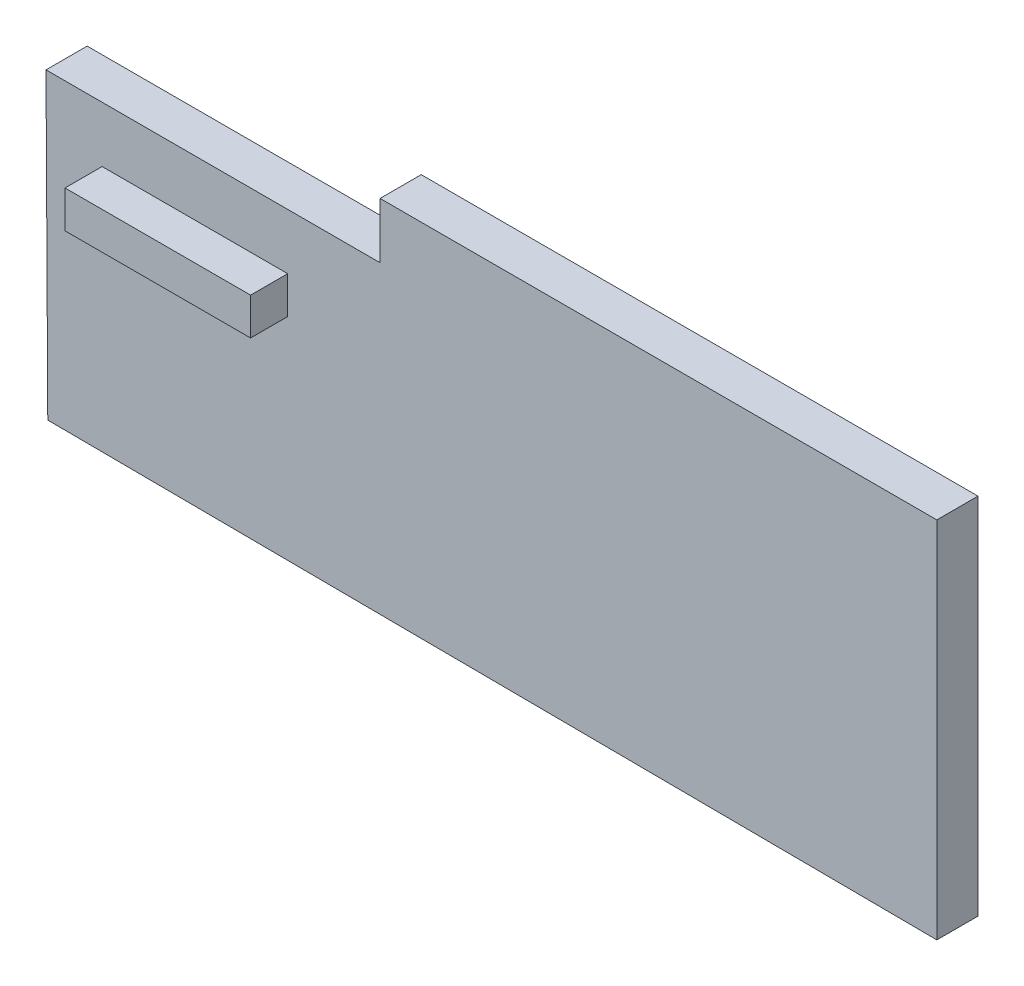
from build123d import *

# Parameters (mm, degrees)
SALIENTE_EXTRUIR1_DEPTH = 1.108783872
CROQUIS2_W              = 5
CROQUIS2_H              = 1
SALIENTE_EXTRUIR2_DEPTH = 1
VACIADO1_T              = -0.15


with BuildPart() as part:
    # Croquis1 → Saliente-Extruir1 (new body)
    with BuildSketch(Plane.XY):
        Polygon((8, 12.5), (-7, 12.5), (-7, 11), (-16, 11), (-15.952152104, 2.852031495), (8, 2.7), align=None)
    extrude(amount=SALIENTE_EXTRUIR1_DEPTH)


with BuildPart() as body_2:
    # Croquis2 → Saliente-Extruir2 (new body)
    with BuildSketch(Plane.XY.offset(1.108783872)):
        with Locations((-11.988186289, 9)):
            Rectangle(CROQUIS2_W, CROQUIS2_H)
    extrude(amount=SALIENTE_EXTRUIR2_DEPTH)

    # Vaciado1
    vaciado1_openings = [body_2.faces().sort_by_distance(p)[0] for p in [
        (-11.988186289, 8.5, 1.608783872),
    ]]
    offset(amount=VACIADO1_T, openings=vaciado1_openings, kind=Kind.INTERSECTION)


with BuildPart() as part_1:
    add(part.part)

    # Combinar1: union body 2
    add(body_2.part)


solid = part_1.part
